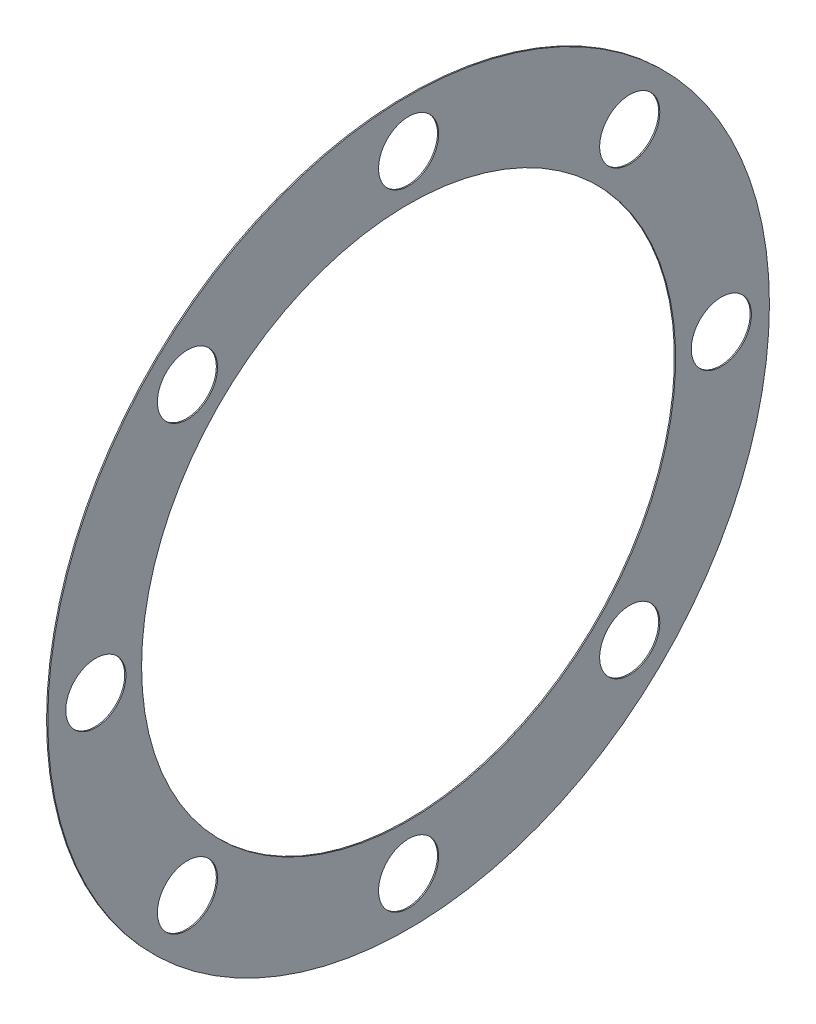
from build123d import *

# Parameters (mm, degrees)
ESQUISSE1_W             = 0.25
ESQUISSE1_H             = 19.5
ESQUISSE2_R             = 6.25
ENL_V_MAT_EXTRU_1_DEPTH = 107.066311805


with BuildPart() as part:
    # Esquisse1 → R_volution1 (revolve)
    with BuildSketch(Plane.XY, mode=Mode.PRIVATE) as r_volution1_sk:
        with Locations((0.125, 65.25)):
            Rectangle(ESQUISSE1_W, ESQUISSE1_H)
    revolve(r_volution1_sk.sketch.rotate(Axis((0, 0, 0), (1, 0, 0)), 90), axis=Axis((0, 0, 0), (1, 0, 0)))

    # Esquisse2 → Enl_v. mat.-Extru.1 (cut, through all)
    with BuildSketch(Plane(origin=(0.25, 0, 0), x_dir=(0, 0, -1), z_dir=(1, 0, 0))):
        with Locations((0, 65)):
            Circle(ESQUISSE2_R)
        with Locations((45.961940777, 45.961940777)):
            Circle(ESQUISSE2_R)
        with Locations((65, 0)):
            Circle(ESQUISSE2_R)
        with Locations((45.961940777, -45.961940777)):
            Circle(ESQUISSE2_R)
        with Locations((0, -65)):
            Circle(ESQUISSE2_R)
        with Locations((-45.961940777, -45.961940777)):
            Circle(ESQUISSE2_R)
        with Locations((-65, 0)):
            Circle(ESQUISSE2_R)
        with Locations((-45.961940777, 45.961940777)):
            Circle(ESQUISSE2_R)
    extrude(amount=-ENL_V_MAT_EXTRU_1_DEPTH, mode=Mode.SUBTRACT)


solid = part.part
